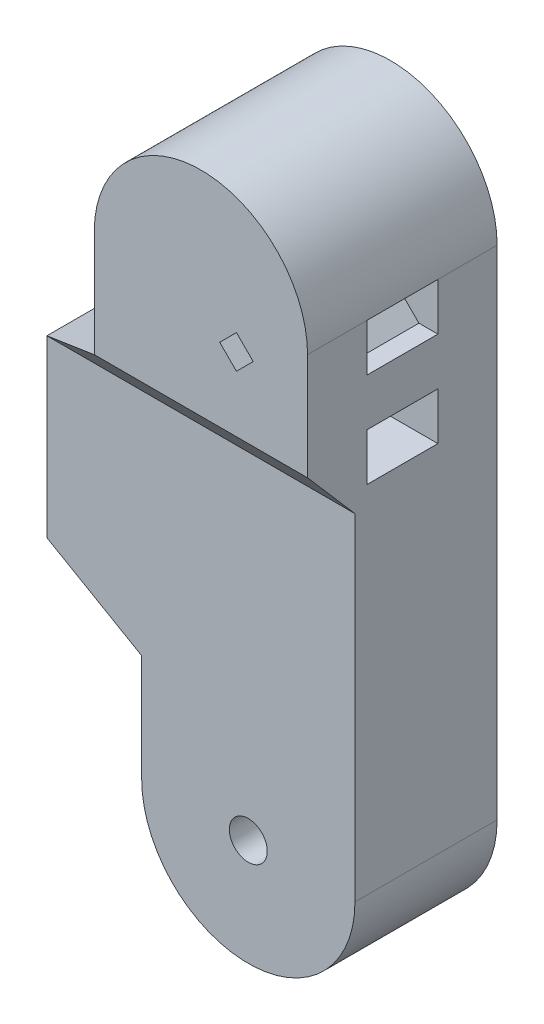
ISO-10303-21;
HEADER;
FILE_DESCRIPTION(('STEP AP214'),'2;1');
FILE_NAME('part.step','',(''),(''),'','','');
FILE_SCHEMA(('AUTOMOTIVE_DESIGN { 1 0 10303 214 1 1 1 1 }'));
ENDSEC;
DATA;
#1=APPLICATION_CONTEXT('core data for automotive mechanical design processes');
#2=APPLICATION_PROTOCOL_DEFINITION('international standard','automotive_design',2000,#1);
#3=PRODUCT_CONTEXT('',#1,'mechanical');
#4=PRODUCT('Part','Part','',(#3));
#5=PRODUCT_RELATED_PRODUCT_CATEGORY('part','',(#4));
#6=PRODUCT_DEFINITION_FORMATION('','',#4);
#7=PRODUCT_DEFINITION_CONTEXT('part definition',#1,'design');
#8=PRODUCT_DEFINITION('design','',#6,#7);
#9=PRODUCT_DEFINITION_SHAPE('','',#8);
#10=(LENGTH_UNIT() NAMED_UNIT(*) SI_UNIT(.MILLI.,.METRE.));
#11=(NAMED_UNIT(*) PLANE_ANGLE_UNIT() SI_UNIT($,.RADIAN.));
#12=(NAMED_UNIT(*) SI_UNIT($,.STERADIAN.) SOLID_ANGLE_UNIT());
#13=UNCERTAINTY_MEASURE_WITH_UNIT(LENGTH_MEASURE(1.E-05),#10,'distance_accuracy_value','');
#14=(GEOMETRIC_REPRESENTATION_CONTEXT(3) GLOBAL_UNCERTAINTY_ASSIGNED_CONTEXT((#13)) GLOBAL_UNIT_ASSIGNED_CONTEXT((#10,
#11,#12)) REPRESENTATION_CONTEXT('',''));
#15=CARTESIAN_POINT('',(0.,0.,0.));
#16=DIRECTION('',(0.,0.,1.));
#17=DIRECTION('',(1.,0.,0.));
#18=AXIS2_PLACEMENT_3D('',#15,#16,#17);
#19=CARTESIAN_POINT('',(22.5,0.,20.));
#20=DIRECTION('',(-1.,0.,0.));
#21=DIRECTION('',(0.,-1.,0.));
#22=AXIS2_PLACEMENT_3D('',#19,#20,#21);
#23=PLANE('',#22);
#24=DIRECTION('',(0.,0.,1.));
#25=VECTOR('',#24,1.);
#26=CARTESIAN_POINT('',(22.5,32.5,-7.5));
#27=LINE('',#26,#25);
#28=CARTESIAN_POINT('',(22.5,32.5,-7.5));
#29=VERTEX_POINT('',#28);
#30=CARTESIAN_POINT('',(22.5,32.5,7.5));
#31=VERTEX_POINT('',#30);
#32=EDGE_CURVE('E315',#29,#31,#27,.T.);
#33=ORIENTED_EDGE('',*,*,#32,.F.);
#34=DIRECTION('',(0.,1.,0.));
#35=VECTOR('',#34,1.);
#36=CARTESIAN_POINT('',(22.5,32.5,-7.5));
#37=LINE('',#36,#35);
#38=CARTESIAN_POINT('',(22.5,22.5,-7.5));
#39=VERTEX_POINT('',#38);
#40=EDGE_CURVE('E380',#39,#29,#37,.T.);
#41=ORIENTED_EDGE('',*,*,#40,.F.);
#42=DIRECTION('',(0.,0.,1.));
#43=VECTOR('',#42,1.);
#44=CARTESIAN_POINT('',(22.5,22.5,-7.5));
#45=LINE('',#44,#43);
#46=CARTESIAN_POINT('',(22.5,22.5,7.5));
#47=VERTEX_POINT('',#46);
#48=EDGE_CURVE('E410',#39,#47,#45,.T.);
#49=ORIENTED_EDGE('',*,*,#48,.T.);
#50=DIRECTION('',(0.,1.,0.));
#51=VECTOR('',#50,1.);
#52=CARTESIAN_POINT('',(22.5,32.5,7.5));
#53=LINE('',#52,#51);
#54=EDGE_CURVE('E359',#47,#31,#53,.T.);
#55=ORIENTED_EDGE('',*,*,#54,.T.);
#56=EDGE_LOOP('',(#33,#41,#49,#55));
#57=FACE_BOUND('',#56,.T.);
#58=DIRECTION('',(0.,1.,0.));
#59=VECTOR('',#58,1.);
#60=CARTESIAN_POINT('',(22.5,42.5,-7.5));
#61=LINE('',#60,#59);
#62=CARTESIAN_POINT('',(22.5,42.5,-7.5));
#63=VERTEX_POINT('',#62);
#64=CARTESIAN_POINT('',(22.5,52.5,-7.5));
#65=VERTEX_POINT('',#64);
#66=EDGE_CURVE('E285',#63,#65,#61,.T.);
#67=ORIENTED_EDGE('',*,*,#66,.F.);
#68=DIRECTION('',(0.,0.,1.));
#69=VECTOR('',#68,1.);
#70=CARTESIAN_POINT('',(22.5,42.5,-7.5));
#71=LINE('',#70,#69);
#72=CARTESIAN_POINT('',(22.5,42.5,7.5));
#73=VERTEX_POINT('',#72);
#74=EDGE_CURVE('E337',#63,#73,#71,.T.);
#75=ORIENTED_EDGE('',*,*,#74,.T.);
#76=DIRECTION('',(0.,1.,0.));
#77=VECTOR('',#76,1.);
#78=CARTESIAN_POINT('',(22.5,42.5,7.5));
#79=LINE('',#78,#77);
#80=CARTESIAN_POINT('',(22.5,52.5,7.5));
#81=VERTEX_POINT('',#80);
#82=EDGE_CURVE('E311',#73,#81,#79,.T.);
#83=ORIENTED_EDGE('',*,*,#82,.T.);
#84=DIRECTION('',(0.,0.,-1.));
#85=VECTOR('',#84,1.);
#86=CARTESIAN_POINT('',(22.5,52.5,20.));
#87=LINE('',#86,#85);
#88=CARTESIAN_POINT('',(22.5,52.5,20.));
#89=VERTEX_POINT('',#88);
#90=EDGE_CURVE('E44',#89,#81,#87,.T.);
#91=ORIENTED_EDGE('',*,*,#90,.F.);
#92=DIRECTION('',(0.,1.,0.));
#93=VECTOR('',#92,1.);
#94=CARTESIAN_POINT('',(22.5,0.,20.));
#95=LINE('',#94,#93);
#96=CARTESIAN_POINT('',(22.5,30.,20.));
#97=VERTEX_POINT('',#96);
#98=EDGE_CURVE('E446',#97,#89,#95,.T.);
#99=ORIENTED_EDGE('',*,*,#98,.F.);
#100=DIRECTION('',(0.,-0.755928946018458,-0.654653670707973));
#101=VECTOR('',#100,1.);
#102=CARTESIAN_POINT('',(22.5,18.4529946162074,10.));
#103=LINE('',#102,#101);
#104=CARTESIAN_POINT('',(22.5,18.4529946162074,10.));
#105=VERTEX_POINT('',#104);
#106=EDGE_CURVE('E426',#97,#105,#103,.T.);
#107=ORIENTED_EDGE('',*,*,#106,.T.);
#108=DIRECTION('',(0.,-1.,0.));
#109=VECTOR('',#108,1.);
#110=CARTESIAN_POINT('',(22.5000000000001,-75.,10.));
#111=LINE('',#110,#109);
#112=CARTESIAN_POINT('',(22.5,-52.5,10.));
#113=VERTEX_POINT('',#112);
#114=EDGE_CURVE('E429',#105,#113,#111,.T.);
#115=ORIENTED_EDGE('',*,*,#114,.T.);
#116=DIRECTION('',(0.,0.,-1.));
#117=VECTOR('',#116,1.);
#118=CARTESIAN_POINT('',(22.5,-52.5,20.));
#119=LINE('',#118,#117);
#120=CARTESIAN_POINT('',(22.5,-52.5,-20.));
#121=VERTEX_POINT('',#120);
#122=EDGE_CURVE('E454',#113,#121,#119,.T.);
#123=ORIENTED_EDGE('',*,*,#122,.T.);
#124=DIRECTION('',(0.,1.,0.));
#125=VECTOR('',#124,1.);
#126=CARTESIAN_POINT('',(22.5,0.,-20.));
#127=LINE('',#126,#125);
#128=CARTESIAN_POINT('',(22.5,52.5,-20.));
#129=VERTEX_POINT('',#128);
#130=EDGE_CURVE('E445',#121,#129,#127,.T.);
#131=ORIENTED_EDGE('',*,*,#130,.T.);
#132=EDGE_CURVE('E488',#65,#129,#87,.T.);
#133=ORIENTED_EDGE('',*,*,#132,.F.);
#134=EDGE_LOOP('',(#67,#75,#83,#91,#99,#107,#115,#123,#131,#133));
#135=FACE_BOUND('',#134,.T.);
#136=ADVANCED_FACE('F36',(#57,#135),#23,.F.);
#137=CARTESIAN_POINT('',(0.,52.5,20.));
#138=DIRECTION('',(0.,0.,-1.));
#139=DIRECTION('',(-1.,0.,0.));
#140=AXIS2_PLACEMENT_3D('',#137,#138,#139);
#141=CYLINDRICAL_SURFACE('',#140,22.5);
#142=CARTESIAN_POINT('',(0.,52.5,-20.));
#143=DIRECTION('',(0.,0.,1.));
#144=DIRECTION('',(1.,0.,0.));
#145=AXIS2_PLACEMENT_3D('',#142,#143,#144);
#146=CIRCLE('',#145,22.5);
#147=CARTESIAN_POINT('',(-22.5,52.5,-20.));
#148=VERTEX_POINT('',#147);
#149=EDGE_CURVE('E457',#129,#148,#146,.T.);
#150=ORIENTED_EDGE('',*,*,#149,.T.);
#151=DIRECTION('',(0.,0.,-1.));
#152=VECTOR('',#151,1.);
#153=CARTESIAN_POINT('',(-22.5,52.5,20.));
#154=LINE('',#153,#152);
#155=CARTESIAN_POINT('',(-22.5,52.5,20.));
#156=VERTEX_POINT('',#155);
#157=EDGE_CURVE('E486',#156,#148,#154,.T.);
#158=ORIENTED_EDGE('',*,*,#157,.F.);
#159=CARTESIAN_POINT('',(0.,52.5,20.));
#160=DIRECTION('',(0.,0.,1.));
#161=DIRECTION('',(1.,0.,0.));
#162=AXIS2_PLACEMENT_3D('',#159,#160,#161);
#163=CIRCLE('',#162,22.5);
#164=EDGE_CURVE('E448',#89,#156,#163,.T.);
#165=ORIENTED_EDGE('',*,*,#164,.F.);
#166=ORIENTED_EDGE('',*,*,#90,.T.);
#167=DIRECTION('',(0.,0.,1.));
#168=VECTOR('',#167,1.);
#169=CARTESIAN_POINT('',(22.5,52.5,-7.5));
#170=LINE('',#169,#168);
#171=EDGE_CURVE('E310',#65,#81,#170,.T.);
#172=ORIENTED_EDGE('',*,*,#171,.F.);
#173=ORIENTED_EDGE('',*,*,#132,.T.);
#174=EDGE_LOOP('',(#150,#158,#165,#166,#172,#173));
#175=FACE_BOUND('',#174,.T.);
#176=ADVANCED_FACE('F496',(#175),#141,.T.);
#177=CARTESIAN_POINT('',(-22.5,0.,20.));
#178=DIRECTION('',(-1.,0.,0.));
#179=DIRECTION('',(0.,-1.,0.));
#180=AXIS2_PLACEMENT_3D('',#177,#178,#179);
#181=PLANE('',#180);
#182=DIRECTION('',(0.,1.,0.));
#183=VECTOR('',#182,1.);
#184=CARTESIAN_POINT('',(-22.5,0.,-20.));
#185=LINE('',#184,#183);
#186=CARTESIAN_POINT('',(-22.5,30.,-20.));
#187=VERTEX_POINT('',#186);
#188=EDGE_CURVE('E460',#187,#148,#185,.T.);
#189=ORIENTED_EDGE('',*,*,#188,.F.);
#190=DIRECTION('',(0.,0.,-1.));
#191=VECTOR('',#190,1.);
#192=CARTESIAN_POINT('',(-22.5,30.,20.));
#193=LINE('',#192,#191);
#194=CARTESIAN_POINT('',(-22.5,30.,20.));
#195=VERTEX_POINT('',#194);
#196=EDGE_CURVE('E484',#195,#187,#193,.T.);
#197=ORIENTED_EDGE('',*,*,#196,.F.);
#198=DIRECTION('',(0.,1.,0.));
#199=VECTOR('',#198,1.);
#200=CARTESIAN_POINT('',(-22.5,0.,20.));
#201=LINE('',#200,#199);
#202=EDGE_CURVE('E451',#195,#156,#201,.T.);
#203=ORIENTED_EDGE('',*,*,#202,.T.);
#204=ORIENTED_EDGE('',*,*,#157,.T.);
#205=EDGE_LOOP('',(#189,#197,#203,#204));
#206=FACE_BOUND('',#205,.T.);
#207=ADVANCED_FACE('F530',(#206),#181,.T.);
#208=CARTESIAN_POINT('',(-18.6153810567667,32.2427857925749,20.));
#209=DIRECTION('',(0.500000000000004,-0.866025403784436,0.));
#210=DIRECTION('',(0.866025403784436,0.500000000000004,0.));
#211=AXIS2_PLACEMENT_3D('',#208,#209,#210);
#212=PLANE('',#211);
#213=DIRECTION('',(0.,0.,-1.));
#214=VECTOR('',#213,1.);
#215=CARTESIAN_POINT('',(-42.5,18.4529946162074,20.));
#216=LINE('',#215,#214);
#217=CARTESIAN_POINT('',(-42.5,18.4529946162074,10.));
#218=VERTEX_POINT('',#217);
#219=CARTESIAN_POINT('',(-42.5,18.4529946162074,-20.));
#220=VERTEX_POINT('',#219);
#221=EDGE_CURVE('E482',#218,#220,#216,.T.);
#222=ORIENTED_EDGE('',*,*,#221,.F.);
#223=DIRECTION('',(0.794719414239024,0.458831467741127,0.397359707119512));
#224=VECTOR('',#223,1.);
#225=CARTESIAN_POINT('',(-19.2287419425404,31.888661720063,21.6356290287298));
#226=LINE('',#225,#224);
#227=EDGE_CURVE('E436',#218,#195,#226,.T.);
#228=ORIENTED_EDGE('',*,*,#227,.T.);
#229=ORIENTED_EDGE('',*,*,#196,.T.);
#230=DIRECTION('',(-0.866025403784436,-0.500000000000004,0.));
#231=VECTOR('',#230,1.);
#232=CARTESIAN_POINT('',(-18.6153810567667,32.2427857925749,-20.));
#233=LINE('',#232,#231);
#234=EDGE_CURVE('E463',#187,#220,#233,.T.);
#235=ORIENTED_EDGE('',*,*,#234,.T.);
#236=EDGE_LOOP('',(#222,#228,#229,#235));
#237=FACE_BOUND('',#236,.T.);
#238=ADVANCED_FACE('F526',(#237),#212,.F.);
#239=CARTESIAN_POINT('',(-42.5,0.,20.));
#240=DIRECTION('',(1.,0.,0.));
#241=DIRECTION('',(0.,1.,0.));
#242=AXIS2_PLACEMENT_3D('',#239,#240,#241);
#243=PLANE('',#242);
#244=DIRECTION('',(0.,0.,-1.));
#245=VECTOR('',#244,1.);
#246=CARTESIAN_POINT('',(-42.5,-18.4529946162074,20.));
#247=LINE('',#246,#245);
#248=CARTESIAN_POINT('',(-42.5,-18.4529946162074,10.));
#249=VERTEX_POINT('',#248);
#250=CARTESIAN_POINT('',(-42.5,-18.4529946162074,-20.));
#251=VERTEX_POINT('',#250);
#252=EDGE_CURVE('E480',#249,#251,#247,.T.);
#253=ORIENTED_EDGE('',*,*,#252,.F.);
#254=DIRECTION('',(0.,-1.,0.));
#255=VECTOR('',#254,1.);
#256=CARTESIAN_POINT('',(-42.5,-75.,10.));
#257=LINE('',#256,#255);
#258=EDGE_CURVE('E340',#218,#249,#257,.T.);
#259=ORIENTED_EDGE('',*,*,#258,.F.);
#260=ORIENTED_EDGE('',*,*,#221,.T.);
#261=DIRECTION('',(0.,-1.,0.));
#262=VECTOR('',#261,1.);
#263=CARTESIAN_POINT('',(-42.5,0.,-20.));
#264=LINE('',#263,#262);
#265=EDGE_CURVE('E467',#220,#251,#264,.T.);
#266=ORIENTED_EDGE('',*,*,#265,.T.);
#267=EDGE_LOOP('',(#253,#259,#260,#266));
#268=FACE_BOUND('',#267,.T.);
#269=ADVANCED_FACE('F522',(#268),#243,.F.);
#270=CARTESIAN_POINT('',(-18.6153810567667,-32.2427857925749,20.));
#271=DIRECTION('',(-0.500000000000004,-0.866025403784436,0.));
#272=DIRECTION('',(0.866025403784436,-0.500000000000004,0.));
#273=AXIS2_PLACEMENT_3D('',#270,#271,#272);
#274=PLANE('',#273);
#275=DIRECTION('',(0.866025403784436,-0.500000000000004,0.));
#276=VECTOR('',#275,1.);
#277=CARTESIAN_POINT('',(-18.6153810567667,-32.2427857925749,10.));
#278=LINE('',#277,#276);
#279=CARTESIAN_POINT('',(-22.5,-30.,10.));
#280=VERTEX_POINT('',#279);
#281=EDGE_CURVE('E443',#249,#280,#278,.T.);
#282=ORIENTED_EDGE('',*,*,#281,.F.);
#283=ORIENTED_EDGE('',*,*,#252,.T.);
#284=DIRECTION('',(-0.866025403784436,0.500000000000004,0.));
#285=VECTOR('',#284,1.);
#286=CARTESIAN_POINT('',(-18.6153810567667,-32.2427857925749,-20.));
#287=LINE('',#286,#285);
#288=CARTESIAN_POINT('',(-22.5,-30.,-20.));
#289=VERTEX_POINT('',#288);
#290=EDGE_CURVE('E470',#289,#251,#287,.T.);
#291=ORIENTED_EDGE('',*,*,#290,.F.);
#292=DIRECTION('',(0.,0.,-1.));
#293=VECTOR('',#292,1.);
#294=CARTESIAN_POINT('',(-22.5,-30.,20.));
#295=LINE('',#294,#293);
#296=EDGE_CURVE('E478',#280,#289,#295,.T.);
#297=ORIENTED_EDGE('',*,*,#296,.F.);
#298=EDGE_LOOP('',(#282,#283,#291,#297));
#299=FACE_BOUND('',#298,.T.);
#300=ADVANCED_FACE('F518',(#299),#274,.T.);
#301=DIRECTION('',(0.,-1.,0.));
#302=VECTOR('',#301,1.);
#303=CARTESIAN_POINT('',(-22.5,0.,10.));
#304=LINE('',#303,#302);
#305=CARTESIAN_POINT('',(-22.5,-52.5,10.));
#306=VERTEX_POINT('',#305);
#307=EDGE_CURVE('E441',#280,#306,#304,.T.);
#308=ORIENTED_EDGE('',*,*,#307,.F.);
#309=ORIENTED_EDGE('',*,*,#296,.T.);
#310=CARTESIAN_POINT('',(-22.5,-52.5,-20.));
#311=VERTEX_POINT('',#310);
#312=EDGE_CURVE('E464',#311,#289,#185,.T.);
#313=ORIENTED_EDGE('',*,*,#312,.F.);
#314=DIRECTION('',(0.,0.,-1.));
#315=VECTOR('',#314,1.);
#316=CARTESIAN_POINT('',(-22.5,-52.5,20.));
#317=LINE('',#316,#315);
#318=EDGE_CURVE('E476',#306,#311,#317,.T.);
#319=ORIENTED_EDGE('',*,*,#318,.F.);
#320=EDGE_LOOP('',(#308,#309,#313,#319));
#321=FACE_BOUND('',#320,.T.);
#322=ADVANCED_FACE('F513',(#321),#181,.T.);
#323=CARTESIAN_POINT('',(0.,-52.5,20.));
#324=DIRECTION('',(0.,0.,-1.));
#325=DIRECTION('',(-1.,0.,0.));
#326=AXIS2_PLACEMENT_3D('',#323,#324,#325);
#327=CYLINDRICAL_SURFACE('',#326,22.5);
#328=ORIENTED_EDGE('',*,*,#122,.F.);
#329=CARTESIAN_POINT('',(0.,-52.5,10.));
#330=DIRECTION('',(0.,0.,-1.));
#331=DIRECTION('',(-1.,0.,0.));
#332=AXIS2_PLACEMENT_3D('',#329,#330,#331);
#333=CIRCLE('',#332,22.5);
#334=EDGE_CURVE('E11',#113,#306,#333,.T.);
#335=ORIENTED_EDGE('',*,*,#334,.T.);
#336=ORIENTED_EDGE('',*,*,#318,.T.);
#337=CARTESIAN_POINT('',(0.,-52.5,-20.));
#338=DIRECTION('',(0.,0.,1.));
#339=DIRECTION('',(1.,0.,0.));
#340=AXIS2_PLACEMENT_3D('',#337,#338,#339);
#341=CIRCLE('',#340,22.5);
#342=EDGE_CURVE('E449',#311,#121,#341,.T.);
#343=ORIENTED_EDGE('',*,*,#342,.T.);
#344=EDGE_LOOP('',(#328,#335,#336,#343));
#345=FACE_BOUND('',#344,.T.);
#346=ADVANCED_FACE('F507',(#345),#327,.T.);
#347=CARTESIAN_POINT('',(0.,0.,20.));
#348=DIRECTION('',(0.,0.,1.));
#349=DIRECTION('',(1.,0.,0.));
#350=AXIS2_PLACEMENT_3D('',#347,#348,#349);
#351=PLANE('',#350);
#352=DIRECTION('',(-0.707106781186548,-0.707106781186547,0.));
#353=VECTOR('',#352,1.);
#354=CARTESIAN_POINT('',(-20.7677669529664,20.7677669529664,20.));
#355=LINE('',#354,#353);
#356=CARTESIAN_POINT('',(7.49999999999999,49.0355339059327,20.));
#357=VERTEX_POINT('',#356);
#358=CARTESIAN_POINT('',(3.96446609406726,45.5,20.));
#359=VERTEX_POINT('',#358);
#360=EDGE_CURVE('E282',#357,#359,#355,.T.);
#361=ORIENTED_EDGE('',*,*,#360,.F.);
#362=DIRECTION('',(-0.707106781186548,0.707106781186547,0.));
#363=VECTOR('',#362,1.);
#364=CARTESIAN_POINT('',(28.2677669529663,28.2677669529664,20.));
#365=LINE('',#364,#363);
#366=CARTESIAN_POINT('',(11.0355339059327,45.5,20.));
#367=VERTEX_POINT('',#366);
#368=EDGE_CURVE('E280',#367,#357,#365,.T.);
#369=ORIENTED_EDGE('',*,*,#368,.F.);
#370=DIRECTION('',(0.707106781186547,0.707106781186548,0.));
#371=VECTOR('',#370,1.);
#372=CARTESIAN_POINT('',(-17.2322330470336,17.2322330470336,20.));
#373=LINE('',#372,#371);
#374=CARTESIAN_POINT('',(7.49999999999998,41.9644660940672,20.));
#375=VERTEX_POINT('',#374);
#376=EDGE_CURVE('E278',#375,#367,#373,.T.);
#377=ORIENTED_EDGE('',*,*,#376,.F.);
#378=DIRECTION('',(0.707106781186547,-0.707106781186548,0.));
#379=VECTOR('',#378,1.);
#380=CARTESIAN_POINT('',(24.7322330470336,24.7322330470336,20.));
#381=LINE('',#380,#379);
#382=EDGE_CURVE('E270',#359,#375,#381,.T.);
#383=ORIENTED_EDGE('',*,*,#382,.F.);
#384=EDGE_LOOP('',(#361,#369,#377,#383));
#385=FACE_BOUND('',#384,.T.);
#386=DIRECTION('',(-1.,0.,0.));
#387=VECTOR('',#386,1.);
#388=CARTESIAN_POINT('',(22.5,30.,20.));
#389=LINE('',#388,#387);
#390=EDGE_CURVE('E434',#97,#195,#389,.T.);
#391=ORIENTED_EDGE('',*,*,#390,.F.);
#392=ORIENTED_EDGE('',*,*,#98,.T.);
#393=ORIENTED_EDGE('',*,*,#164,.T.);
#394=ORIENTED_EDGE('',*,*,#202,.F.);
#395=EDGE_LOOP('',(#391,#392,#393,#394));
#396=FACE_BOUND('',#395,.T.);
#397=ADVANCED_FACE('F533',(#385,#396),#351,.T.);
#398=CARTESIAN_POINT('',(0.,0.,-20.));
#399=DIRECTION('',(0.,0.,1.));
#400=DIRECTION('',(1.,0.,0.));
#401=AXIS2_PLACEMENT_3D('',#398,#399,#400);
#402=PLANE('',#401);
#403=CARTESIAN_POINT('',(0.,-52.5,-20.));
#404=DIRECTION('',(0.,0.,-1.));
#405=DIRECTION('',(-1.,0.,0.));
#406=AXIS2_PLACEMENT_3D('',#403,#404,#405);
#407=CIRCLE('',#406,4.);
#408=CARTESIAN_POINT('',(-3.99999999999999,-52.5,-20.));
#409=VERTEX_POINT('',#408);
#410=EDGE_CURVE('E263',#409,#409,#407,.T.);
#411=ORIENTED_EDGE('',*,*,#410,.F.);
#412=EDGE_LOOP('',(#411));
#413=FACE_BOUND('',#412,.T.);
#414=DIRECTION('',(-0.707106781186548,0.707106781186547,0.));
#415=VECTOR('',#414,1.);
#416=CARTESIAN_POINT('',(11.0355339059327,45.5,-20.));
#417=LINE('',#416,#415);
#418=CARTESIAN_POINT('',(11.0355339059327,45.5,-20.));
#419=VERTEX_POINT('',#418);
#420=CARTESIAN_POINT('',(7.49999999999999,49.0355339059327,-20.));
#421=VERTEX_POINT('',#420);
#422=EDGE_CURVE('E260',#419,#421,#417,.T.);
#423=ORIENTED_EDGE('',*,*,#422,.T.);
#424=DIRECTION('',(-0.707106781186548,-0.707106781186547,0.));
#425=VECTOR('',#424,1.);
#426=CARTESIAN_POINT('',(7.49999999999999,49.0355339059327,-20.));
#427=LINE('',#426,#425);
#428=CARTESIAN_POINT('',(3.96446609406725,45.5,-20.));
#429=VERTEX_POINT('',#428);
#430=EDGE_CURVE('E245',#421,#429,#427,.T.);
#431=ORIENTED_EDGE('',*,*,#430,.T.);
#432=DIRECTION('',(0.707106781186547,-0.707106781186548,0.));
#433=VECTOR('',#432,1.);
#434=CARTESIAN_POINT('',(3.96446609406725,45.5,-20.));
#435=LINE('',#434,#433);
#436=CARTESIAN_POINT('',(7.49999999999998,41.9644660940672,-20.));
#437=VERTEX_POINT('',#436);
#438=EDGE_CURVE('E253',#429,#437,#435,.T.);
#439=ORIENTED_EDGE('',*,*,#438,.T.);
#440=DIRECTION('',(0.707106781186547,0.707106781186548,0.));
#441=VECTOR('',#440,1.);
#442=CARTESIAN_POINT('',(7.49999999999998,41.9644660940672,-20.));
#443=LINE('',#442,#441);
#444=EDGE_CURVE('E59',#437,#419,#443,.T.);
#445=ORIENTED_EDGE('',*,*,#444,.T.);
#446=EDGE_LOOP('',(#423,#431,#439,#445));
#447=FACE_BOUND('',#446,.T.);
#448=ORIENTED_EDGE('',*,*,#130,.F.);
#449=ORIENTED_EDGE('',*,*,#342,.F.);
#450=ORIENTED_EDGE('',*,*,#312,.T.);
#451=ORIENTED_EDGE('',*,*,#290,.T.);
#452=ORIENTED_EDGE('',*,*,#265,.F.);
#453=ORIENTED_EDGE('',*,*,#234,.F.);
#454=ORIENTED_EDGE('',*,*,#188,.T.);
#455=ORIENTED_EDGE('',*,*,#149,.F.);
#456=EDGE_LOOP('',(#448,#449,#450,#451,#452,#453,#454,#455));
#457=FACE_BOUND('',#456,.T.);
#458=ADVANCED_FACE('F257',(#413,#447,#457),#402,.F.);
#459=CARTESIAN_POINT('',(22.5000000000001,-75.,10.));
#460=DIRECTION('',(0.,0.,-1.));
#461=DIRECTION('',(-1.,0.,0.));
#462=AXIS2_PLACEMENT_3D('',#459,#460,#461);
#463=PLANE('',#462);
#464=CARTESIAN_POINT('',(0.,-52.5,10.));
#465=DIRECTION('',(0.,0.,-1.));
#466=DIRECTION('',(-1.,0.,0.));
#467=AXIS2_PLACEMENT_3D('',#464,#465,#466);
#468=CIRCLE('',#467,4.);
#469=CARTESIAN_POINT('',(-3.99999999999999,-52.5,10.));
#470=VERTEX_POINT('',#469);
#471=EDGE_CURVE('E39',#470,#470,#468,.T.);
#472=ORIENTED_EDGE('',*,*,#471,.T.);
#473=EDGE_LOOP('',(#472));
#474=FACE_BOUND('',#473,.T.);
#475=ORIENTED_EDGE('',*,*,#281,.T.);
#476=ORIENTED_EDGE('',*,*,#307,.T.);
#477=ORIENTED_EDGE('',*,*,#334,.F.);
#478=ORIENTED_EDGE('',*,*,#114,.F.);
#479=DIRECTION('',(-1.,0.,0.));
#480=VECTOR('',#479,1.);
#481=CARTESIAN_POINT('',(22.5,18.4529946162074,10.));
#482=LINE('',#481,#480);
#483=EDGE_CURVE('E432',#105,#218,#482,.T.);
#484=ORIENTED_EDGE('',*,*,#483,.T.);
#485=ORIENTED_EDGE('',*,*,#258,.T.);
#486=EDGE_LOOP('',(#475,#476,#477,#478,#484,#485));
#487=FACE_BOUND('',#486,.T.);
#488=ADVANCED_FACE('F647',(#474,#487),#463,.F.);
#489=CARTESIAN_POINT('',(22.5,18.4529946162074,10.));
#490=DIRECTION('',(0.,0.654653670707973,-0.755928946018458));
#491=DIRECTION('',(0.,0.755928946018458,0.654653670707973));
#492=AXIS2_PLACEMENT_3D('',#489,#490,#491);
#493=PLANE('',#492);
#494=ORIENTED_EDGE('',*,*,#483,.F.);
#495=ORIENTED_EDGE('',*,*,#106,.F.);
#496=ORIENTED_EDGE('',*,*,#390,.T.);
#497=ORIENTED_EDGE('',*,*,#227,.F.);
#498=EDGE_LOOP('',(#494,#495,#496,#497));
#499=FACE_BOUND('',#498,.T.);
#500=ADVANCED_FACE('F650',(#499),#493,.F.);
#501=CARTESIAN_POINT('',(18.5,42.5,-7.5));
#502=DIRECTION('',(0.,-1.,0.));
#503=DIRECTION('',(0.,0.,-1.));
#504=AXIS2_PLACEMENT_3D('',#501,#502,#503);
#505=PLANE('',#504);
#506=DIRECTION('',(1.,0.,0.));
#507=VECTOR('',#506,1.);
#508=CARTESIAN_POINT('',(18.5,42.5,7.5));
#509=LINE('',#508,#507);
#510=CARTESIAN_POINT('',(18.5,42.5,7.5));
#511=VERTEX_POINT('',#510);
#512=EDGE_CURVE('E288',#511,#73,#509,.T.);
#513=ORIENTED_EDGE('',*,*,#512,.T.);
#514=ORIENTED_EDGE('',*,*,#74,.F.);
#515=DIRECTION('',(1.,0.,0.));
#516=VECTOR('',#515,1.);
#517=CARTESIAN_POINT('',(18.5,42.5,-7.5));
#518=LINE('',#517,#516);
#519=CARTESIAN_POINT('',(18.5,42.5,-7.5));
#520=VERTEX_POINT('',#519);
#521=EDGE_CURVE('E307',#520,#63,#518,.T.);
#522=ORIENTED_EDGE('',*,*,#521,.F.);
#523=DIRECTION('',(0.,0.,1.));
#524=VECTOR('',#523,1.);
#525=CARTESIAN_POINT('',(18.5,42.5,-7.5));
#526=LINE('',#525,#524);
#527=EDGE_CURVE('E341',#520,#511,#526,.T.);
#528=ORIENTED_EDGE('',*,*,#527,.T.);
#529=EDGE_LOOP('',(#513,#514,#522,#528));
#530=FACE_BOUND('',#529,.T.);
#531=ADVANCED_FACE('F542',(#530),#505,.F.);
#532=CARTESIAN_POINT('',(15.5,45.5,-7.5));
#533=DIRECTION('',(-0.707106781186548,-0.707106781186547,0.));
#534=DIRECTION('',(0.707106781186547,-0.707106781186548,0.));
#535=AXIS2_PLACEMENT_3D('',#532,#533,#534);
#536=PLANE('',#535);
#537=DIRECTION('',(0.707106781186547,-0.707106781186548,0.));
#538=VECTOR('',#537,1.);
#539=CARTESIAN_POINT('',(15.5,45.5,7.5));
#540=LINE('',#539,#538);
#541=CARTESIAN_POINT('',(15.5,45.5,7.5));
#542=VERTEX_POINT('',#541);
#543=EDGE_CURVE('E332',#542,#511,#540,.T.);
#544=ORIENTED_EDGE('',*,*,#543,.T.);
#545=ORIENTED_EDGE('',*,*,#527,.F.);
#546=DIRECTION('',(0.707106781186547,-0.707106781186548,0.));
#547=VECTOR('',#546,1.);
#548=CARTESIAN_POINT('',(15.5,45.5,-7.5));
#549=LINE('',#548,#547);
#550=CARTESIAN_POINT('',(15.5,45.5,-7.5));
#551=VERTEX_POINT('',#550);
#552=EDGE_CURVE('E304',#551,#520,#549,.T.);
#553=ORIENTED_EDGE('',*,*,#552,.F.);
#554=DIRECTION('',(0.,0.,1.));
#555=VECTOR('',#554,1.);
#556=CARTESIAN_POINT('',(15.5,45.5,-7.5));
#557=LINE('',#556,#555);
#558=EDGE_CURVE('E343',#551,#542,#557,.T.);
#559=ORIENTED_EDGE('',*,*,#558,.T.);
#560=EDGE_LOOP('',(#544,#545,#553,#559));
#561=FACE_BOUND('',#560,.T.);
#562=ADVANCED_FACE('F546',(#561),#536,.F.);
#563=CARTESIAN_POINT('',(11.0355339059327,45.5,-7.5));
#564=DIRECTION('',(0.,-1.,0.));
#565=DIRECTION('',(1.,0.,0.));
#566=AXIS2_PLACEMENT_3D('',#563,#564,#565);
#567=PLANE('',#566);
#568=DIRECTION('',(1.,0.,0.));
#569=VECTOR('',#568,1.);
#570=CARTESIAN_POINT('',(11.0355339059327,45.5,7.5));
#571=LINE('',#570,#569);
#572=CARTESIAN_POINT('',(11.0355339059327,45.5,7.5));
#573=VERTEX_POINT('',#572);
#574=EDGE_CURVE('E329',#573,#542,#571,.T.);
#575=ORIENTED_EDGE('',*,*,#574,.T.);
#576=ORIENTED_EDGE('',*,*,#558,.F.);
#577=DIRECTION('',(1.,0.,0.));
#578=VECTOR('',#577,1.);
#579=CARTESIAN_POINT('',(11.0355339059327,45.5,-7.5));
#580=LINE('',#579,#578);
#581=CARTESIAN_POINT('',(11.0355339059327,45.5,-7.5));
#582=VERTEX_POINT('',#581);
#583=EDGE_CURVE('E301',#582,#551,#580,.T.);
#584=ORIENTED_EDGE('',*,*,#583,.F.);
#585=DIRECTION('',(0.,0.,1.));
#586=VECTOR('',#585,1.);
#587=CARTESIAN_POINT('',(11.0355339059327,45.5,-7.5));
#588=LINE('',#587,#586);
#589=EDGE_CURVE('E345',#582,#573,#588,.T.);
#590=ORIENTED_EDGE('',*,*,#589,.T.);
#591=EDGE_LOOP('',(#575,#576,#584,#590));
#592=FACE_BOUND('',#591,.T.);
#593=ADVANCED_FACE('F550',(#592),#567,.F.);
#594=CARTESIAN_POINT('',(-2.50000000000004,45.5,-7.5));
#595=DIRECTION('',(0.,-1.,0.));
#596=DIRECTION('',(1.,0.,0.));
#597=AXIS2_PLACEMENT_3D('',#594,#595,#596);
#598=PLANE('',#597);
#599=DIRECTION('',(1.,0.,0.));
#600=VECTOR('',#599,1.);
#601=CARTESIAN_POINT('',(-2.50000000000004,45.5,7.5));
#602=LINE('',#601,#600);
#603=CARTESIAN_POINT('',(-2.50000000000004,45.5,7.5));
#604=VERTEX_POINT('',#603);
#605=CARTESIAN_POINT('',(3.96446609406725,45.5,7.5));
#606=VERTEX_POINT('',#605);
#607=EDGE_CURVE('E321',#604,#606,#602,.T.);
#608=ORIENTED_EDGE('',*,*,#607,.T.);
#609=DIRECTION('',(0.,0.,1.));
#610=VECTOR('',#609,1.);
#611=CARTESIAN_POINT('',(3.96446609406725,45.5,-7.5));
#612=LINE('',#611,#610);
#613=CARTESIAN_POINT('',(3.96446609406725,45.5,-7.5));
#614=VERTEX_POINT('',#613);
#615=EDGE_CURVE('E348',#614,#606,#612,.T.);
#616=ORIENTED_EDGE('',*,*,#615,.F.);
#617=DIRECTION('',(1.,0.,0.));
#618=VECTOR('',#617,1.);
#619=CARTESIAN_POINT('',(-2.50000000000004,45.5,-7.5));
#620=LINE('',#619,#618);
#621=CARTESIAN_POINT('',(-2.50000000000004,45.5,-7.5));
#622=VERTEX_POINT('',#621);
#623=EDGE_CURVE('E294',#622,#614,#620,.T.);
#624=ORIENTED_EDGE('',*,*,#623,.F.);
#625=DIRECTION('',(0.,0.,1.));
#626=VECTOR('',#625,1.);
#627=CARTESIAN_POINT('',(-2.50000000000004,45.5,-7.5));
#628=LINE('',#627,#626);
#629=EDGE_CURVE('E350',#622,#604,#628,.T.);
#630=ORIENTED_EDGE('',*,*,#629,.T.);
#631=EDGE_LOOP('',(#608,#616,#624,#630));
#632=FACE_BOUND('',#631,.T.);
#633=ADVANCED_FACE('F562',(#632),#598,.F.);
#634=CARTESIAN_POINT('',(-9.50000000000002,52.5,-7.5));
#635=DIRECTION('',(-0.707106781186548,-0.707106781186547,0.));
#636=DIRECTION('',(0.707106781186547,-0.707106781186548,0.));
#637=AXIS2_PLACEMENT_3D('',#634,#635,#636);
#638=PLANE('',#637);
#639=DIRECTION('',(0.707106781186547,-0.707106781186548,0.));
#640=VECTOR('',#639,1.);
#641=CARTESIAN_POINT('',(-9.50000000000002,52.5,7.5));
#642=LINE('',#641,#640);
#643=CARTESIAN_POINT('',(-9.50000000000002,52.5,7.5));
#644=VERTEX_POINT('',#643);
#645=EDGE_CURVE('E318',#644,#604,#642,.T.);
#646=ORIENTED_EDGE('',*,*,#645,.T.);
#647=ORIENTED_EDGE('',*,*,#629,.F.);
#648=DIRECTION('',(0.707106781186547,-0.707106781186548,0.));
#649=VECTOR('',#648,1.);
#650=CARTESIAN_POINT('',(-9.50000000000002,52.5,-7.5));
#651=LINE('',#650,#649);
#652=CARTESIAN_POINT('',(-9.50000000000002,52.5,-7.5));
#653=VERTEX_POINT('',#652);
#654=EDGE_CURVE('E291',#653,#622,#651,.T.);
#655=ORIENTED_EDGE('',*,*,#654,.F.);
#656=DIRECTION('',(0.,0.,1.));
#657=VECTOR('',#656,1.);
#658=CARTESIAN_POINT('',(-9.50000000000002,52.5,-7.5));
#659=LINE('',#658,#657);
#660=EDGE_CURVE('E352',#653,#644,#659,.T.);
#661=ORIENTED_EDGE('',*,*,#660,.T.);
#662=EDGE_LOOP('',(#646,#647,#655,#661));
#663=FACE_BOUND('',#662,.T.);
#664=ADVANCED_FACE('F704',(#663),#638,.F.);
#665=CARTESIAN_POINT('',(22.5,52.5,-7.5));
#666=DIRECTION('',(0.,1.,0.));
#667=DIRECTION('',(-1.,0.,0.));
#668=AXIS2_PLACEMENT_3D('',#665,#666,#667);
#669=PLANE('',#668);
#670=DIRECTION('',(-1.,0.,0.));
#671=VECTOR('',#670,1.);
#672=CARTESIAN_POINT('',(22.5,52.5,7.5));
#673=LINE('',#672,#671);
#674=EDGE_CURVE('E314',#81,#644,#673,.T.);
#675=ORIENTED_EDGE('',*,*,#674,.T.);
#676=ORIENTED_EDGE('',*,*,#660,.F.);
#677=DIRECTION('',(-1.,0.,0.));
#678=VECTOR('',#677,1.);
#679=CARTESIAN_POINT('',(22.5,52.5,-7.5));
#680=LINE('',#679,#678);
#681=EDGE_CURVE('E287',#65,#653,#680,.T.);
#682=ORIENTED_EDGE('',*,*,#681,.F.);
#683=ORIENTED_EDGE('',*,*,#171,.T.);
#684=EDGE_LOOP('',(#675,#676,#682,#683));
#685=FACE_BOUND('',#684,.T.);
#686=ADVANCED_FACE('F709',(#685),#669,.F.);
#687=CARTESIAN_POINT('',(0.,0.,-7.5));
#688=DIRECTION('',(0.,0.,1.));
#689=DIRECTION('',(1.,0.,0.));
#690=AXIS2_PLACEMENT_3D('',#687,#688,#689);
#691=PLANE('',#690);
#692=ORIENTED_EDGE('',*,*,#66,.T.);
#693=ORIENTED_EDGE('',*,*,#681,.T.);
#694=ORIENTED_EDGE('',*,*,#654,.T.);
#695=ORIENTED_EDGE('',*,*,#623,.T.);
#696=DIRECTION('',(0.707106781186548,0.707106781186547,0.));
#697=VECTOR('',#696,1.);
#698=CARTESIAN_POINT('',(3.96446609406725,45.5,-7.5));
#699=LINE('',#698,#697);
#700=CARTESIAN_POINT('',(7.49999999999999,49.0355339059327,-7.5));
#701=VERTEX_POINT('',#700);
#702=EDGE_CURVE('E248',#614,#701,#699,.T.);
#703=ORIENTED_EDGE('',*,*,#702,.T.);
#704=DIRECTION('',(0.707106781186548,-0.707106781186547,0.));
#705=VECTOR('',#704,1.);
#706=CARTESIAN_POINT('',(7.49999999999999,49.0355339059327,-7.5));
#707=LINE('',#706,#705);
#708=EDGE_CURVE('E298',#701,#582,#707,.T.);
#709=ORIENTED_EDGE('',*,*,#708,.T.);
#710=ORIENTED_EDGE('',*,*,#583,.T.);
#711=ORIENTED_EDGE('',*,*,#552,.T.);
#712=ORIENTED_EDGE('',*,*,#521,.T.);
#713=EDGE_LOOP('',(#692,#693,#694,#695,#703,#709,#710,#711,#712));
#714=FACE_BOUND('',#713,.T.);
#715=ADVANCED_FACE('F558',(#714),#691,.T.);
#716=CARTESIAN_POINT('',(0.,0.,7.5));
#717=DIRECTION('',(0.,0.,1.));
#718=DIRECTION('',(1.,0.,0.));
#719=AXIS2_PLACEMENT_3D('',#716,#717,#718);
#720=PLANE('',#719);
#721=ORIENTED_EDGE('',*,*,#82,.F.);
#722=ORIENTED_EDGE('',*,*,#512,.F.);
#723=ORIENTED_EDGE('',*,*,#543,.F.);
#724=ORIENTED_EDGE('',*,*,#574,.F.);
#725=DIRECTION('',(0.707106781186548,-0.707106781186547,0.));
#726=VECTOR('',#725,1.);
#727=CARTESIAN_POINT('',(7.49999999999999,49.0355339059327,7.5));
#728=LINE('',#727,#726);
#729=CARTESIAN_POINT('',(7.49999999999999,49.0355339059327,7.5));
#730=VERTEX_POINT('',#729);
#731=EDGE_CURVE('E327',#730,#573,#728,.T.);
#732=ORIENTED_EDGE('',*,*,#731,.F.);
#733=DIRECTION('',(0.707106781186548,0.707106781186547,0.));
#734=VECTOR('',#733,1.);
#735=CARTESIAN_POINT('',(3.96446609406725,45.5,7.5));
#736=LINE('',#735,#734);
#737=EDGE_CURVE('E324',#606,#730,#736,.T.);
#738=ORIENTED_EDGE('',*,*,#737,.F.);
#739=ORIENTED_EDGE('',*,*,#607,.F.);
#740=ORIENTED_EDGE('',*,*,#645,.F.);
#741=ORIENTED_EDGE('',*,*,#674,.F.);
#742=EDGE_LOOP('',(#721,#722,#723,#724,#732,#738,#739,#740,#741));
#743=FACE_BOUND('',#742,.T.);
#744=ADVANCED_FACE('F538',(#743),#720,.F.);
#745=CARTESIAN_POINT('',(18.5,32.5,-7.5));
#746=DIRECTION('',(0.,1.,0.));
#747=DIRECTION('',(0.,0.,1.));
#748=AXIS2_PLACEMENT_3D('',#745,#746,#747);
#749=PLANE('',#748);
#750=DIRECTION('',(-1.,0.,0.));
#751=VECTOR('',#750,1.);
#752=CARTESIAN_POINT('',(18.5,32.5,7.5));
#753=LINE('',#752,#751);
#754=CARTESIAN_POINT('',(18.5,32.5,7.5));
#755=VERTEX_POINT('',#754);
#756=EDGE_CURVE('E284',#31,#755,#753,.T.);
#757=ORIENTED_EDGE('',*,*,#756,.T.);
#758=DIRECTION('',(0.,0.,1.));
#759=VECTOR('',#758,1.);
#760=CARTESIAN_POINT('',(18.5,32.5,-7.5));
#761=LINE('',#760,#759);
#762=CARTESIAN_POINT('',(18.5,32.5,-7.5));
#763=VERTEX_POINT('',#762);
#764=EDGE_CURVE('E383',#763,#755,#761,.T.);
#765=ORIENTED_EDGE('',*,*,#764,.F.);
#766=DIRECTION('',(-1.,0.,0.));
#767=VECTOR('',#766,1.);
#768=CARTESIAN_POINT('',(18.5,32.5,-7.5));
#769=LINE('',#768,#767);
#770=EDGE_CURVE('E355',#29,#763,#769,.T.);
#771=ORIENTED_EDGE('',*,*,#770,.F.);
#772=ORIENTED_EDGE('',*,*,#32,.T.);
#773=EDGE_LOOP('',(#757,#765,#771,#772));
#774=FACE_BOUND('',#773,.T.);
#775=ADVANCED_FACE('F595',(#774),#749,.F.);
#776=CARTESIAN_POINT('',(22.5,22.5,-7.5));
#777=DIRECTION('',(0.,-1.,0.));
#778=DIRECTION('',(1.,0.,0.));
#779=AXIS2_PLACEMENT_3D('',#776,#777,#778);
#780=PLANE('',#779);
#781=DIRECTION('',(1.,0.,0.));
#782=VECTOR('',#781,1.);
#783=CARTESIAN_POINT('',(22.5,22.5,7.5));
#784=LINE('',#783,#782);
#785=CARTESIAN_POINT('',(-9.50000000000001,22.5,7.5));
#786=VERTEX_POINT('',#785);
#787=EDGE_CURVE('E404',#786,#47,#784,.T.);
#788=ORIENTED_EDGE('',*,*,#787,.T.);
#789=ORIENTED_EDGE('',*,*,#48,.F.);
#790=DIRECTION('',(1.,0.,0.));
#791=VECTOR('',#790,1.);
#792=CARTESIAN_POINT('',(22.5,22.5,-7.5));
#793=LINE('',#792,#791);
#794=CARTESIAN_POINT('',(-9.50000000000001,22.5,-7.5));
#795=VERTEX_POINT('',#794);
#796=EDGE_CURVE('E377',#795,#39,#793,.T.);
#797=ORIENTED_EDGE('',*,*,#796,.F.);
#798=DIRECTION('',(0.,0.,1.));
#799=VECTOR('',#798,1.);
#800=CARTESIAN_POINT('',(-9.50000000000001,22.5,-7.5));
#801=LINE('',#800,#799);
#802=EDGE_CURVE('E413',#795,#786,#801,.T.);
#803=ORIENTED_EDGE('',*,*,#802,.T.);
#804=EDGE_LOOP('',(#788,#789,#797,#803));
#805=FACE_BOUND('',#804,.T.);
#806=ADVANCED_FACE('F602',(#805),#780,.F.);
#807=CARTESIAN_POINT('',(-9.50000000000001,22.5,-7.5));
#808=DIRECTION('',(-0.707106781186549,0.707106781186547,0.));
#809=DIRECTION('',(-0.707106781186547,-0.707106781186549,0.));
#810=AXIS2_PLACEMENT_3D('',#807,#808,#809);
#811=PLANE('',#810);
#812=DIRECTION('',(-0.707106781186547,-0.707106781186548,0.));
#813=VECTOR('',#812,1.);
#814=CARTESIAN_POINT('',(-9.50000000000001,22.5,7.5));
#815=LINE('',#814,#813);
#816=CARTESIAN_POINT('',(-2.50000000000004,29.5,7.5));
#817=VERTEX_POINT('',#816);
#818=EDGE_CURVE('E401',#817,#786,#815,.T.);
#819=ORIENTED_EDGE('',*,*,#818,.T.);
#820=ORIENTED_EDGE('',*,*,#802,.F.);
#821=DIRECTION('',(-0.707106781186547,-0.707106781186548,0.));
#822=VECTOR('',#821,1.);
#823=CARTESIAN_POINT('',(-9.50000000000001,22.5,-7.5));
#824=LINE('',#823,#822);
#825=CARTESIAN_POINT('',(-2.50000000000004,29.5,-7.5));
#826=VERTEX_POINT('',#825);
#827=EDGE_CURVE('E374',#826,#795,#824,.T.);
#828=ORIENTED_EDGE('',*,*,#827,.F.);
#829=DIRECTION('',(0.,0.,1.));
#830=VECTOR('',#829,1.);
#831=CARTESIAN_POINT('',(-2.50000000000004,29.5,-7.5));
#832=LINE('',#831,#830);
#833=EDGE_CURVE('E415',#826,#817,#832,.T.);
#834=ORIENTED_EDGE('',*,*,#833,.T.);
#835=EDGE_LOOP('',(#819,#820,#828,#834));
#836=FACE_BOUND('',#835,.T.);
#837=ADVANCED_FACE('F626',(#836),#811,.F.);
#838=CARTESIAN_POINT('',(-2.50000000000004,29.5,-7.5));
#839=DIRECTION('',(0.,1.,0.));
#840=DIRECTION('',(-1.,0.,0.));
#841=AXIS2_PLACEMENT_3D('',#838,#839,#840);
#842=PLANE('',#841);
#843=DIRECTION('',(-1.,0.,0.));
#844=VECTOR('',#843,1.);
#845=CARTESIAN_POINT('',(-2.50000000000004,29.5,7.5));
#846=LINE('',#845,#844);
#847=CARTESIAN_POINT('',(3.96446609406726,29.5,7.5));
#848=VERTEX_POINT('',#847);
#849=EDGE_CURVE('E398',#848,#817,#846,.T.);
#850=ORIENTED_EDGE('',*,*,#849,.T.);
#851=ORIENTED_EDGE('',*,*,#833,.F.);
#852=DIRECTION('',(-1.,0.,0.));
#853=VECTOR('',#852,1.);
#854=CARTESIAN_POINT('',(-2.50000000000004,29.5,-7.5));
#855=LINE('',#854,#853);
#856=CARTESIAN_POINT('',(3.96446609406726,29.5,-7.5));
#857=VERTEX_POINT('',#856);
#858=EDGE_CURVE('E371',#857,#826,#855,.T.);
#859=ORIENTED_EDGE('',*,*,#858,.F.);
#860=DIRECTION('',(0.,0.,1.));
#861=VECTOR('',#860,1.);
#862=CARTESIAN_POINT('',(3.96446609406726,29.5,-7.5));
#863=LINE('',#862,#861);
#864=EDGE_CURVE('E417',#857,#848,#863,.T.);
#865=ORIENTED_EDGE('',*,*,#864,.T.);
#866=EDGE_LOOP('',(#850,#851,#859,#865));
#867=FACE_BOUND('',#866,.T.);
#868=ADVANCED_FACE('F623',(#867),#842,.F.);
#869=CARTESIAN_POINT('',(3.96446609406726,29.5,-7.5));
#870=DIRECTION('',(0.707106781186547,0.707106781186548,0.));
#871=DIRECTION('',(-0.707106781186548,0.707106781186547,0.));
#872=AXIS2_PLACEMENT_3D('',#869,#870,#871);
#873=PLANE('',#872);
#874=DIRECTION('',(-0.707106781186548,0.707106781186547,0.));
#875=VECTOR('',#874,1.);
#876=CARTESIAN_POINT('',(3.96446609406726,29.5,7.5));
#877=LINE('',#876,#875);
#878=CARTESIAN_POINT('',(7.5,25.9644660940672,7.5));
#879=VERTEX_POINT('',#878);
#880=EDGE_CURVE('E395',#879,#848,#877,.T.);
#881=ORIENTED_EDGE('',*,*,#880,.T.);
#882=ORIENTED_EDGE('',*,*,#864,.F.);
#883=DIRECTION('',(-0.707106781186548,0.707106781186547,0.));
#884=VECTOR('',#883,1.);
#885=CARTESIAN_POINT('',(3.96446609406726,29.5,-7.5));
#886=LINE('',#885,#884);
#887=CARTESIAN_POINT('',(7.5,25.9644660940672,-7.5));
#888=VERTEX_POINT('',#887);
#889=EDGE_CURVE('E368',#888,#857,#886,.T.);
#890=ORIENTED_EDGE('',*,*,#889,.F.);
#891=DIRECTION('',(0.,0.,1.));
#892=VECTOR('',#891,1.);
#893=CARTESIAN_POINT('',(7.5,25.9644660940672,-7.5));
#894=LINE('',#893,#892);
#895=EDGE_CURVE('E419',#888,#879,#894,.T.);
#896=ORIENTED_EDGE('',*,*,#895,.T.);
#897=EDGE_LOOP('',(#881,#882,#890,#896));
#898=FACE_BOUND('',#897,.T.);
#899=ADVANCED_FACE('F620',(#898),#873,.F.);
#900=CARTESIAN_POINT('',(7.5,25.9644660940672,-7.5));
#901=DIRECTION('',(-0.707106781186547,0.707106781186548,0.));
#902=DIRECTION('',(-0.707106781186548,-0.707106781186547,0.));
#903=AXIS2_PLACEMENT_3D('',#900,#901,#902);
#904=PLANE('',#903);
#905=DIRECTION('',(-0.707106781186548,-0.707106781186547,0.));
#906=VECTOR('',#905,1.);
#907=CARTESIAN_POINT('',(7.5,25.9644660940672,7.5));
#908=LINE('',#907,#906);
#909=CARTESIAN_POINT('',(11.0355339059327,29.5,7.5));
#910=VERTEX_POINT('',#909);
#911=EDGE_CURVE('E392',#910,#879,#908,.T.);
#912=ORIENTED_EDGE('',*,*,#911,.T.);
#913=ORIENTED_EDGE('',*,*,#895,.F.);
#914=DIRECTION('',(-0.707106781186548,-0.707106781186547,0.));
#915=VECTOR('',#914,1.);
#916=CARTESIAN_POINT('',(7.5,25.9644660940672,-7.5));
#917=LINE('',#916,#915);
#918=CARTESIAN_POINT('',(11.0355339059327,29.5,-7.5));
#919=VERTEX_POINT('',#918);
#920=EDGE_CURVE('E365',#919,#888,#917,.T.);
#921=ORIENTED_EDGE('',*,*,#920,.F.);
#922=DIRECTION('',(0.,0.,1.));
#923=VECTOR('',#922,1.);
#924=CARTESIAN_POINT('',(11.0355339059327,29.5,-7.5));
#925=LINE('',#924,#923);
#926=EDGE_CURVE('E421',#919,#910,#925,.T.);
#927=ORIENTED_EDGE('',*,*,#926,.T.);
#928=EDGE_LOOP('',(#912,#913,#921,#927));
#929=FACE_BOUND('',#928,.T.);
#930=ADVANCED_FACE('F616',(#929),#904,.F.);
#931=CARTESIAN_POINT('',(11.0355339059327,29.5,-7.5));
#932=DIRECTION('',(0.,1.,0.));
#933=DIRECTION('',(-1.,0.,0.));
#934=AXIS2_PLACEMENT_3D('',#931,#932,#933);
#935=PLANE('',#934);
#936=DIRECTION('',(-1.,0.,0.));
#937=VECTOR('',#936,1.);
#938=CARTESIAN_POINT('',(11.0355339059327,29.5,7.5));
#939=LINE('',#938,#937);
#940=CARTESIAN_POINT('',(15.5,29.5,7.5));
#941=VERTEX_POINT('',#940);
#942=EDGE_CURVE('E389',#941,#910,#939,.T.);
#943=ORIENTED_EDGE('',*,*,#942,.T.);
#944=ORIENTED_EDGE('',*,*,#926,.F.);
#945=DIRECTION('',(-1.,0.,0.));
#946=VECTOR('',#945,1.);
#947=CARTESIAN_POINT('',(11.0355339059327,29.5,-7.5));
#948=LINE('',#947,#946);
#949=CARTESIAN_POINT('',(15.5,29.5,-7.5));
#950=VERTEX_POINT('',#949);
#951=EDGE_CURVE('E362',#950,#919,#948,.T.);
#952=ORIENTED_EDGE('',*,*,#951,.F.);
#953=DIRECTION('',(0.,0.,1.));
#954=VECTOR('',#953,1.);
#955=CARTESIAN_POINT('',(15.5,29.5,-7.5));
#956=LINE('',#955,#954);
#957=EDGE_CURVE('E423',#950,#941,#956,.T.);
#958=ORIENTED_EDGE('',*,*,#957,.T.);
#959=EDGE_LOOP('',(#943,#944,#952,#958));
#960=FACE_BOUND('',#959,.T.);
#961=ADVANCED_FACE('F614',(#960),#935,.F.);
#962=CARTESIAN_POINT('',(15.5,29.5,-7.5));
#963=DIRECTION('',(-0.707106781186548,0.707106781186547,0.));
#964=DIRECTION('',(-0.707106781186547,-0.707106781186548,0.));
#965=AXIS2_PLACEMENT_3D('',#962,#963,#964);
#966=PLANE('',#965);
#967=DIRECTION('',(-0.707106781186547,-0.707106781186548,0.));
#968=VECTOR('',#967,1.);
#969=CARTESIAN_POINT('',(15.5,29.5,7.5));
#970=LINE('',#969,#968);
#971=EDGE_CURVE('E386',#755,#941,#970,.T.);
#972=ORIENTED_EDGE('',*,*,#971,.T.);
#973=ORIENTED_EDGE('',*,*,#957,.F.);
#974=DIRECTION('',(-0.707106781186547,-0.707106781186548,0.));
#975=VECTOR('',#974,1.);
#976=CARTESIAN_POINT('',(15.5,29.5,-7.5));
#977=LINE('',#976,#975);
#978=EDGE_CURVE('E358',#763,#950,#977,.T.);
#979=ORIENTED_EDGE('',*,*,#978,.F.);
#980=ORIENTED_EDGE('',*,*,#764,.T.);
#981=EDGE_LOOP('',(#972,#973,#979,#980));
#982=FACE_BOUND('',#981,.T.);
#983=ADVANCED_FACE('F610',(#982),#966,.F.);
#984=CARTESIAN_POINT('',(0.,0.,-7.5));
#985=DIRECTION('',(0.,0.,-1.));
#986=DIRECTION('',(-1.,0.,0.));
#987=AXIS2_PLACEMENT_3D('',#984,#985,#986);
#988=PLANE('',#987);
#989=ORIENTED_EDGE('',*,*,#770,.T.);
#990=ORIENTED_EDGE('',*,*,#978,.T.);
#991=ORIENTED_EDGE('',*,*,#951,.T.);
#992=ORIENTED_EDGE('',*,*,#920,.T.);
#993=ORIENTED_EDGE('',*,*,#889,.T.);
#994=ORIENTED_EDGE('',*,*,#858,.T.);
#995=ORIENTED_EDGE('',*,*,#827,.T.);
#996=ORIENTED_EDGE('',*,*,#796,.T.);
#997=ORIENTED_EDGE('',*,*,#40,.T.);
#998=EDGE_LOOP('',(#989,#990,#991,#992,#993,#994,#995,#996,#997));
#999=FACE_BOUND('',#998,.T.);
#1000=ADVANCED_FACE('F598',(#999),#988,.F.);
#1001=CARTESIAN_POINT('',(0.,0.,7.5));
#1002=DIRECTION('',(0.,0.,-1.));
#1003=DIRECTION('',(-1.,0.,0.));
#1004=AXIS2_PLACEMENT_3D('',#1001,#1002,#1003);
#1005=PLANE('',#1004);
#1006=ORIENTED_EDGE('',*,*,#756,.F.);
#1007=ORIENTED_EDGE('',*,*,#54,.F.);
#1008=ORIENTED_EDGE('',*,*,#787,.F.);
#1009=ORIENTED_EDGE('',*,*,#818,.F.);
#1010=ORIENTED_EDGE('',*,*,#849,.F.);
#1011=ORIENTED_EDGE('',*,*,#880,.F.);
#1012=ORIENTED_EDGE('',*,*,#911,.F.);
#1013=ORIENTED_EDGE('',*,*,#942,.F.);
#1014=ORIENTED_EDGE('',*,*,#971,.F.);
#1015=EDGE_LOOP('',(#1006,#1007,#1008,#1009,#1010,#1011,#1012,#1013,#1014));
#1016=FACE_BOUND('',#1015,.T.);
#1017=ADVANCED_FACE('F582',(#1016),#1005,.T.);
#1018=CARTESIAN_POINT('',(7.49999999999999,49.0355339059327,-20.));
#1019=DIRECTION('',(-0.707106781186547,0.707106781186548,0.));
#1020=DIRECTION('',(-0.707106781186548,-0.707106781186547,0.));
#1021=AXIS2_PLACEMENT_3D('',#1018,#1019,#1020);
#1022=PLANE('',#1021);
#1023=ORIENTED_EDGE('',*,*,#360,.T.);
#1024=DIRECTION('',(0.,0.,1.));
#1025=VECTOR('',#1024,1.);
#1026=CARTESIAN_POINT('',(3.96446609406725,45.5,-20.));
#1027=LINE('',#1026,#1025);
#1028=EDGE_CURVE('E51',#606,#359,#1027,.T.);
#1029=ORIENTED_EDGE('',*,*,#1028,.F.);
#1030=ORIENTED_EDGE('',*,*,#737,.T.);
#1031=DIRECTION('',(0.,0.,1.));
#1032=VECTOR('',#1031,1.);
#1033=CARTESIAN_POINT('',(7.49999999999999,49.0355339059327,-20.));
#1034=LINE('',#1033,#1032);
#1035=EDGE_CURVE('E271',#730,#357,#1034,.T.);
#1036=ORIENTED_EDGE('',*,*,#1035,.T.);
#1037=EDGE_LOOP('',(#1023,#1029,#1030,#1036));
#1038=FACE_BOUND('',#1037,.T.);
#1039=ADVANCED_FACE('F567',(#1038),#1022,.F.);
#1040=CARTESIAN_POINT('',(11.0355339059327,45.5,-20.));
#1041=DIRECTION('',(0.707106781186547,0.707106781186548,0.));
#1042=DIRECTION('',(-0.707106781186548,0.707106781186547,0.));
#1043=AXIS2_PLACEMENT_3D('',#1040,#1041,#1042);
#1044=PLANE('',#1043);
#1045=ORIENTED_EDGE('',*,*,#368,.T.);
#1046=ORIENTED_EDGE('',*,*,#1035,.F.);
#1047=ORIENTED_EDGE('',*,*,#731,.T.);
#1048=DIRECTION('',(0.,0.,1.));
#1049=VECTOR('',#1048,1.);
#1050=CARTESIAN_POINT('',(11.0355339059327,45.5,-20.));
#1051=LINE('',#1050,#1049);
#1052=EDGE_CURVE('E275',#573,#367,#1051,.T.);
#1053=ORIENTED_EDGE('',*,*,#1052,.T.);
#1054=EDGE_LOOP('',(#1045,#1046,#1047,#1053));
#1055=FACE_BOUND('',#1054,.T.);
#1056=ADVANCED_FACE('F574',(#1055),#1044,.F.);
#1057=ORIENTED_EDGE('',*,*,#702,.F.);
#1058=EDGE_CURVE('E240',#429,#614,#1027,.T.);
#1059=ORIENTED_EDGE('',*,*,#1058,.F.);
#1060=ORIENTED_EDGE('',*,*,#430,.F.);
#1061=EDGE_CURVE('E268',#421,#701,#1034,.T.);
#1062=ORIENTED_EDGE('',*,*,#1061,.T.);
#1063=EDGE_LOOP('',(#1057,#1059,#1060,#1062));
#1064=FACE_BOUND('',#1063,.T.);
#1065=ADVANCED_FACE('F242',(#1064),#1022,.F.);
#1066=ORIENTED_EDGE('',*,*,#708,.F.);
#1067=ORIENTED_EDGE('',*,*,#1061,.F.);
#1068=ORIENTED_EDGE('',*,*,#422,.F.);
#1069=EDGE_CURVE('E272',#419,#582,#1051,.T.);
#1070=ORIENTED_EDGE('',*,*,#1069,.T.);
#1071=EDGE_LOOP('',(#1066,#1067,#1068,#1070));
#1072=FACE_BOUND('',#1071,.T.);
#1073=ADVANCED_FACE('F556',(#1072),#1044,.F.);
#1074=CARTESIAN_POINT('',(7.49999999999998,41.9644660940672,-20.));
#1075=DIRECTION('',(0.707106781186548,-0.707106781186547,0.));
#1076=DIRECTION('',(0.707106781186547,0.707106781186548,0.));
#1077=AXIS2_PLACEMENT_3D('',#1074,#1075,#1076);
#1078=PLANE('',#1077);
#1079=ORIENTED_EDGE('',*,*,#376,.T.);
#1080=ORIENTED_EDGE('',*,*,#1052,.F.);
#1081=ORIENTED_EDGE('',*,*,#589,.F.);
#1082=ORIENTED_EDGE('',*,*,#1069,.F.);
#1083=ORIENTED_EDGE('',*,*,#444,.F.);
#1084=DIRECTION('',(0.,0.,1.));
#1085=VECTOR('',#1084,1.);
#1086=CARTESIAN_POINT('',(7.49999999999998,41.9644660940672,-20.));
#1087=LINE('',#1086,#1085);
#1088=EDGE_CURVE('E250',#437,#375,#1087,.T.);
#1089=ORIENTED_EDGE('',*,*,#1088,.T.);
#1090=EDGE_LOOP('',(#1079,#1080,#1081,#1082,#1083,#1089));
#1091=FACE_BOUND('',#1090,.T.);
#1092=ADVANCED_FACE('F553',(#1091),#1078,.F.);
#1093=CARTESIAN_POINT('',(3.96446609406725,45.5,-20.));
#1094=DIRECTION('',(-0.707106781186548,-0.707106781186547,0.));
#1095=DIRECTION('',(0.707106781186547,-0.707106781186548,0.));
#1096=AXIS2_PLACEMENT_3D('',#1093,#1094,#1095);
#1097=PLANE('',#1096);
#1098=ORIENTED_EDGE('',*,*,#382,.T.);
#1099=ORIENTED_EDGE('',*,*,#1088,.F.);
#1100=ORIENTED_EDGE('',*,*,#438,.F.);
#1101=ORIENTED_EDGE('',*,*,#1058,.T.);
#1102=ORIENTED_EDGE('',*,*,#615,.T.);
#1103=ORIENTED_EDGE('',*,*,#1028,.T.);
#1104=EDGE_LOOP('',(#1098,#1099,#1100,#1101,#1102,#1103));
#1105=FACE_BOUND('',#1104,.T.);
#1106=ADVANCED_FACE('F254',(#1105),#1097,.F.);
#1107=CARTESIAN_POINT('',(0.,-52.5,20.));
#1108=DIRECTION('',(0.,0.,-1.));
#1109=DIRECTION('',(-1.,0.,0.));
#1110=AXIS2_PLACEMENT_3D('',#1107,#1108,#1109);
#1111=CYLINDRICAL_SURFACE('',#1110,4.);
#1112=ORIENTED_EDGE('',*,*,#410,.T.);
#1113=EDGE_LOOP('',(#1112));
#1114=FACE_BOUND('',#1113,.T.);
#1115=ORIENTED_EDGE('',*,*,#471,.F.);
#1116=EDGE_LOOP('',(#1115));
#1117=FACE_BOUND('',#1116,.T.);
#1118=ADVANCED_FACE('F856',(#1114,#1117),#1111,.F.);
#1119=CLOSED_SHELL('',(#136,#176,#207,#238,#269,#300,#322,#346,#397,#458,#488,#500,#531,#562,
#593,#633,#664,#686,#715,#744,#775,#806,#837,#868,#899,#930,#961,#983,#1000,#1017,#1039,#1056,
#1065,#1073,#1092,#1106,#1118));
#1120=MANIFOLD_SOLID_BREP('B2',#1119);
#1121=ADVANCED_BREP_SHAPE_REPRESENTATION('',(#18,#1120),#14);
#1122=SHAPE_DEFINITION_REPRESENTATION(#9,#1121);
ENDSEC;
END-ISO-10303-21;
